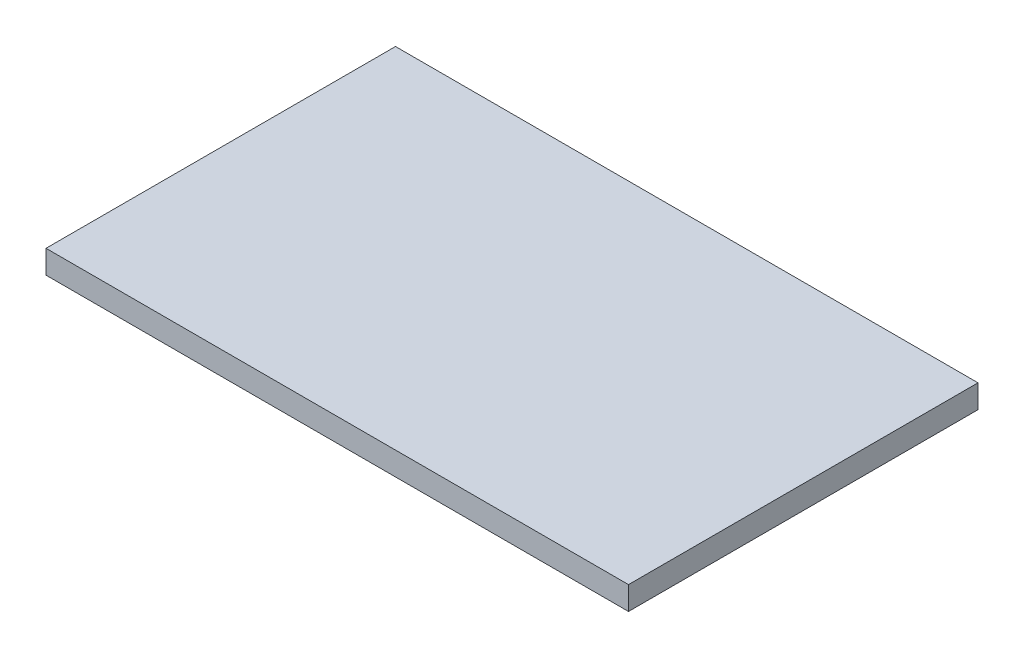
ISO-10303-21;
HEADER;
FILE_DESCRIPTION(('STEP AP214'),'2;1');
FILE_NAME('part.step','',(''),(''),'','','');
FILE_SCHEMA(('AUTOMOTIVE_DESIGN { 1 0 10303 214 1 1 1 1 }'));
ENDSEC;
DATA;
#1=APPLICATION_CONTEXT('core data for automotive mechanical design processes');
#2=APPLICATION_PROTOCOL_DEFINITION('international standard','automotive_design',2000,#1);
#3=PRODUCT_CONTEXT('',#1,'mechanical');
#4=PRODUCT('Part','Part','',(#3));
#5=PRODUCT_RELATED_PRODUCT_CATEGORY('part','',(#4));
#6=PRODUCT_DEFINITION_FORMATION('','',#4);
#7=PRODUCT_DEFINITION_CONTEXT('part definition',#1,'design');
#8=PRODUCT_DEFINITION('design','',#6,#7);
#9=PRODUCT_DEFINITION_SHAPE('','',#8);
#10=(LENGTH_UNIT() NAMED_UNIT(*) SI_UNIT(.MILLI.,.METRE.));
#11=(NAMED_UNIT(*) PLANE_ANGLE_UNIT() SI_UNIT($,.RADIAN.));
#12=(NAMED_UNIT(*) SI_UNIT($,.STERADIAN.) SOLID_ANGLE_UNIT());
#13=UNCERTAINTY_MEASURE_WITH_UNIT(LENGTH_MEASURE(1.E-05),#10,'distance_accuracy_value','');
#14=(GEOMETRIC_REPRESENTATION_CONTEXT(3) GLOBAL_UNCERTAINTY_ASSIGNED_CONTEXT((#13)) GLOBAL_UNIT_ASSIGNED_CONTEXT((#10,
#11,#12)) REPRESENTATION_CONTEXT('',''));
#15=CARTESIAN_POINT('',(0.,0.,0.));
#16=DIRECTION('',(0.,0.,1.));
#17=DIRECTION('',(1.,0.,0.));
#18=AXIS2_PLACEMENT_3D('',#15,#16,#17);
#19=CARTESIAN_POINT('',(0.,4.,0.));
#20=DIRECTION('',(1.,0.,0.));
#21=DIRECTION('',(0.,0.,-1.));
#22=AXIS2_PLACEMENT_3D('',#19,#20,#21);
#23=PLANE('',#22);
#24=DIRECTION('',(0.,0.,1.));
#25=VECTOR('',#24,1.);
#26=CARTESIAN_POINT('',(0.,0.,0.));
#27=LINE('',#26,#25);
#28=CARTESIAN_POINT('',(0.,0.,-60.));
#29=VERTEX_POINT('',#28);
#30=CARTESIAN_POINT('',(0.,0.,0.));
#31=VERTEX_POINT('',#30);
#32=EDGE_CURVE('E94',#29,#31,#27,.T.);
#33=ORIENTED_EDGE('',*,*,#32,.T.);
#34=DIRECTION('',(0.,-1.,0.));
#35=VECTOR('',#34,1.);
#36=CARTESIAN_POINT('',(0.,4.,0.));
#37=LINE('',#36,#35);
#38=CARTESIAN_POINT('',(0.,4.,0.));
#39=VERTEX_POINT('',#38);
#40=EDGE_CURVE('E11',#39,#31,#37,.T.);
#41=ORIENTED_EDGE('',*,*,#40,.F.);
#42=DIRECTION('',(0.,0.,1.));
#43=VECTOR('',#42,1.);
#44=CARTESIAN_POINT('',(0.,4.,0.));
#45=LINE('',#44,#43);
#46=CARTESIAN_POINT('',(0.,4.,-60.));
#47=VERTEX_POINT('',#46);
#48=EDGE_CURVE('E82',#47,#39,#45,.T.);
#49=ORIENTED_EDGE('',*,*,#48,.F.);
#50=DIRECTION('',(0.,-1.,0.));
#51=VECTOR('',#50,1.);
#52=CARTESIAN_POINT('',(0.,4.,-60.));
#53=LINE('',#52,#51);
#54=EDGE_CURVE('E90',#47,#29,#53,.T.);
#55=ORIENTED_EDGE('',*,*,#54,.T.);
#56=EDGE_LOOP('',(#33,#41,#49,#55));
#57=FACE_BOUND('',#56,.T.);
#58=ADVANCED_FACE('F31',(#57),#23,.F.);
#59=CARTESIAN_POINT('',(0.,4.,0.));
#60=DIRECTION('',(0.,0.,-1.));
#61=DIRECTION('',(-1.,0.,0.));
#62=AXIS2_PLACEMENT_3D('',#59,#60,#61);
#63=PLANE('',#62);
#64=DIRECTION('',(1.,0.,0.));
#65=VECTOR('',#64,1.);
#66=CARTESIAN_POINT('',(0.,0.,0.));
#67=LINE('',#66,#65);
#68=CARTESIAN_POINT('',(100.,0.,0.));
#69=VERTEX_POINT('',#68);
#70=EDGE_CURVE('E86',#31,#69,#67,.T.);
#71=ORIENTED_EDGE('',*,*,#70,.T.);
#72=DIRECTION('',(0.,-1.,0.));
#73=VECTOR('',#72,1.);
#74=CARTESIAN_POINT('',(100.,4.,0.));
#75=LINE('',#74,#73);
#76=CARTESIAN_POINT('',(100.,4.,0.));
#77=VERTEX_POINT('',#76);
#78=EDGE_CURVE('E39',#77,#69,#75,.T.);
#79=ORIENTED_EDGE('',*,*,#78,.F.);
#80=DIRECTION('',(1.,0.,0.));
#81=VECTOR('',#80,1.);
#82=CARTESIAN_POINT('',(0.,4.,0.));
#83=LINE('',#82,#81);
#84=EDGE_CURVE('E77',#39,#77,#83,.T.);
#85=ORIENTED_EDGE('',*,*,#84,.F.);
#86=ORIENTED_EDGE('',*,*,#40,.T.);
#87=EDGE_LOOP('',(#71,#79,#85,#86));
#88=FACE_BOUND('',#87,.T.);
#89=ADVANCED_FACE('F85',(#88),#63,.F.);
#90=CARTESIAN_POINT('',(100.,4.,0.));
#91=DIRECTION('',(-1.,0.,0.));
#92=DIRECTION('',(0.,0.,1.));
#93=AXIS2_PLACEMENT_3D('',#90,#91,#92);
#94=PLANE('',#93);
#95=DIRECTION('',(0.,0.,-1.));
#96=VECTOR('',#95,1.);
#97=CARTESIAN_POINT('',(100.,0.,0.));
#98=LINE('',#97,#96);
#99=CARTESIAN_POINT('',(100.,0.,-60.));
#100=VERTEX_POINT('',#99);
#101=EDGE_CURVE('E64',#69,#100,#98,.T.);
#102=ORIENTED_EDGE('',*,*,#101,.T.);
#103=DIRECTION('',(0.,-1.,0.));
#104=VECTOR('',#103,1.);
#105=CARTESIAN_POINT('',(100.,4.,-60.));
#106=LINE('',#105,#104);
#107=CARTESIAN_POINT('',(100.,4.,-60.));
#108=VERTEX_POINT('',#107);
#109=EDGE_CURVE('E87',#108,#100,#106,.T.);
#110=ORIENTED_EDGE('',*,*,#109,.F.);
#111=DIRECTION('',(0.,0.,-1.));
#112=VECTOR('',#111,1.);
#113=CARTESIAN_POINT('',(100.,4.,0.));
#114=LINE('',#113,#112);
#115=EDGE_CURVE('E80',#77,#108,#114,.T.);
#116=ORIENTED_EDGE('',*,*,#115,.F.);
#117=ORIENTED_EDGE('',*,*,#78,.T.);
#118=EDGE_LOOP('',(#102,#110,#116,#117));
#119=FACE_BOUND('',#118,.T.);
#120=ADVANCED_FACE('F88',(#119),#94,.F.);
#121=CARTESIAN_POINT('',(0.,4.,-60.));
#122=DIRECTION('',(0.,0.,1.));
#123=DIRECTION('',(1.,0.,0.));
#124=AXIS2_PLACEMENT_3D('',#121,#122,#123);
#125=PLANE('',#124);
#126=DIRECTION('',(-1.,0.,0.));
#127=VECTOR('',#126,1.);
#128=CARTESIAN_POINT('',(0.,0.,-60.));
#129=LINE('',#128,#127);
#130=EDGE_CURVE('E70',#100,#29,#129,.T.);
#131=ORIENTED_EDGE('',*,*,#130,.T.);
#132=ORIENTED_EDGE('',*,*,#54,.F.);
#133=DIRECTION('',(-1.,0.,0.));
#134=VECTOR('',#133,1.);
#135=CARTESIAN_POINT('',(0.,4.,-60.));
#136=LINE('',#135,#134);
#137=EDGE_CURVE('E47',#108,#47,#136,.T.);
#138=ORIENTED_EDGE('',*,*,#137,.F.);
#139=ORIENTED_EDGE('',*,*,#109,.T.);
#140=EDGE_LOOP('',(#131,#132,#138,#139));
#141=FACE_BOUND('',#140,.T.);
#142=ADVANCED_FACE('F101',(#141),#125,.F.);
#143=CARTESIAN_POINT('',(0.,4.,-60.));
#144=DIRECTION('',(0.,-1.,0.));
#145=DIRECTION('',(0.,0.,-1.));
#146=AXIS2_PLACEMENT_3D('',#143,#144,#145);
#147=PLANE('',#146);
#148=ORIENTED_EDGE('',*,*,#48,.T.);
#149=ORIENTED_EDGE('',*,*,#84,.T.);
#150=ORIENTED_EDGE('',*,*,#115,.T.);
#151=ORIENTED_EDGE('',*,*,#137,.T.);
#152=EDGE_LOOP('',(#148,#149,#150,#151));
#153=FACE_BOUND('',#152,.T.);
#154=ADVANCED_FACE('F78',(#153),#147,.F.);
#155=CARTESIAN_POINT('',(0.,0.,-60.));
#156=DIRECTION('',(0.,-1.,0.));
#157=DIRECTION('',(0.,0.,-1.));
#158=AXIS2_PLACEMENT_3D('',#155,#156,#157);
#159=PLANE('',#158);
#160=ORIENTED_EDGE('',*,*,#32,.F.);
#161=ORIENTED_EDGE('',*,*,#130,.F.);
#162=ORIENTED_EDGE('',*,*,#101,.F.);
#163=ORIENTED_EDGE('',*,*,#70,.F.);
#164=EDGE_LOOP('',(#160,#161,#162,#163));
#165=FACE_BOUND('',#164,.T.);
#166=ADVANCED_FACE('F104',(#165),#159,.T.);
#167=CLOSED_SHELL('',(#58,#89,#120,#142,#154,#166));
#168=MANIFOLD_SOLID_BREP('B2',#167);
#169=ADVANCED_BREP_SHAPE_REPRESENTATION('',(#18,#168),#14);
#170=SHAPE_DEFINITION_REPRESENTATION(#9,#169);
ENDSEC;
END-ISO-10303-21;
